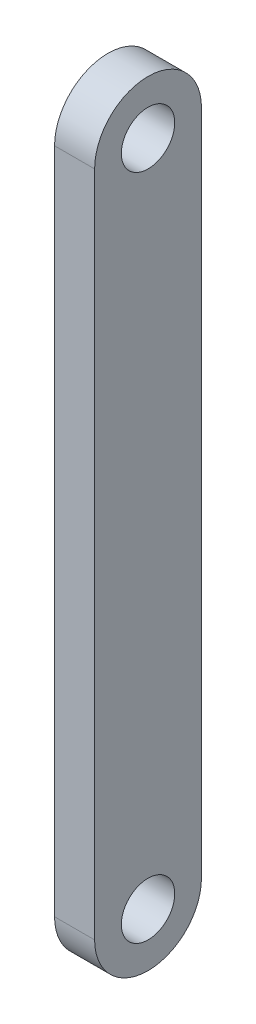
from build123d import *

# Parameters (mm, degrees)
SKETCH1_R           = 2
BOSS_EXTRUDE1_DEPTH = 3


with BuildPart() as part:
    # Sketch1 → Boss-Extrude1 (new body)
    with BuildSketch(Plane(origin=(0, 0, 0), x_dir=(0, 0, -1), z_dir=(1, 0, 0))):
        with BuildLine():
            Line((4, 50), (4, 0))
            ThreePointArc((4, 0), (0, -4), (-4, 0))
            Line((-4, 0), (-4, 50))
            ThreePointArc((-4, 50), (0, 54), (4, 50))
        make_face()
        Circle(SKETCH1_R, mode=Mode.SUBTRACT)
        with Locations((0, 50)):
            Circle(SKETCH1_R, mode=Mode.SUBTRACT)
    extrude(amount=BOSS_EXTRUDE1_DEPTH)


solid = part.part
